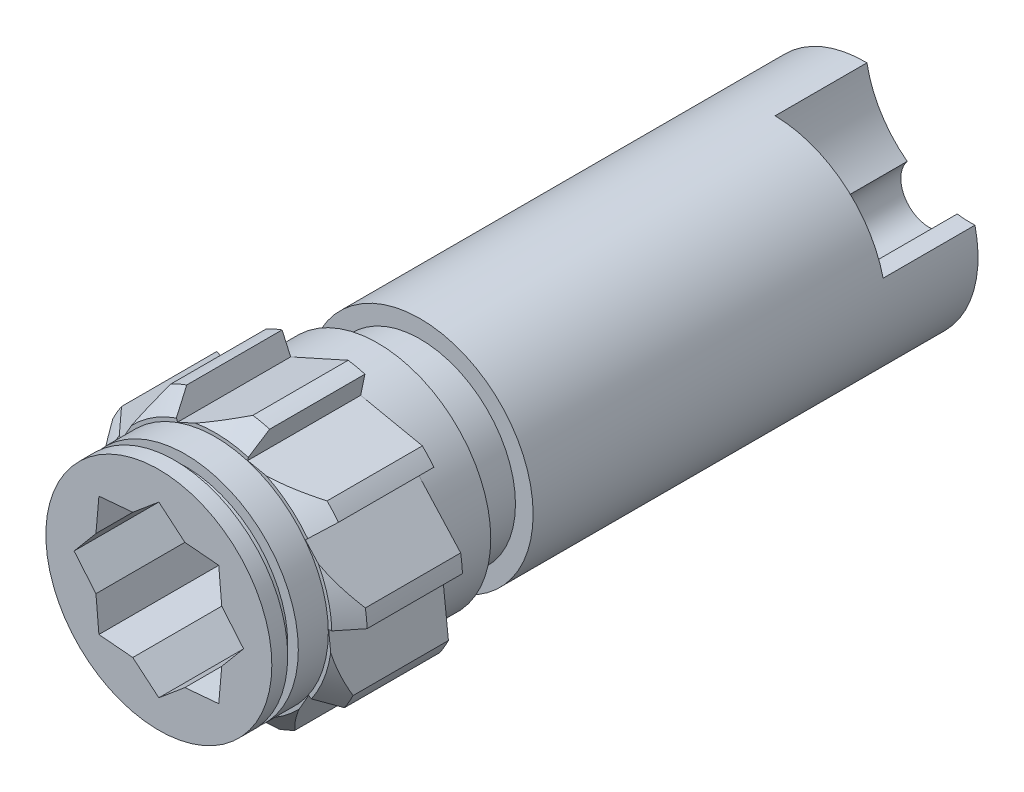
from build123d import *

# Parameters (mm, degrees)
ESQUISSE1_R                  = 16
ESQUISSE1_R_2                = 5
BASE_EXTRUSION_DEPTH         = 100
ESQUISSE2_R                  = 8
ENL_V_MAT_EXTRU_1_DEPTH      = 87.5
ESQUISSE3_OUTSIDE_W          = 55.952
ESQUISSE3_OUTSIDE_H          = 55.952
ESQUISSE3_OUTSIDE_R          = 13.5
ENL_V_MAT_EXTRU_2_DEPTH      = 6
ESQUISSE4_OUTSIDE_W          = 55.952
ESQUISSE4_OUTSIDE_H          = 55.952
ESQUISSE4_OUTSIDE_R          = 14.5
ENL_V_MAT_EXTRU_3_DEPTH      = 1.5
ENL_V_MAT_EXTRU_4_DEPTH      = 20
ESQUISSE7_R                  = 12
ENL_V_MAT_EXTRU_5_DEPTH      = 2
BOSS_EXTRU_1_START           = -16
ESQUISSE8_R                  = 19
ESQUISSE8_R_2                = 16
BOSS_EXTRU_1_DEPTH           = 16
ESQUISSE9_R                  = 4
ENL_V_MAT_EXTRU_6_DEPTH      = 13
ESQUISSE10_R                 = 15
ENL_V_MAT_EXTRU_8_DEPTH      = 13
R_P_TITION_CIRCULAIRE1_COUNT = 2
CHANFREIN1_SIZE              = 2.5
ENL_V_MAT_EXTRU_9_REACH      = 97.844
R_P_TITION_CIRCULAIRE2_COUNT = 10


with BuildPart() as part:
    # Esquisse1 → Base-Extrusion (new body)
    with BuildSketch(Plane.XY):
        Circle(ESQUISSE1_R)
        Circle(ESQUISSE1_R_2, mode=Mode.SUBTRACT)
    extrude(amount=BASE_EXTRUSION_DEPTH)

    # Esquisse2 → Enl_v. mat.-Extru.1 (cut)
    with BuildSketch(Plane.XY.offset(100)):
        Circle(ESQUISSE2_R)
    extrude(amount=-ENL_V_MAT_EXTRU_1_DEPTH, mode=Mode.SUBTRACT)

    # Esquisse3 outside → Enl_v. mat.-Extru.2 (cut)
    with BuildSketch(Plane.XY.offset(69)):
        Rectangle(ESQUISSE3_OUTSIDE_W, ESQUISSE3_OUTSIDE_H)
        Circle(ESQUISSE3_OUTSIDE_R, mode=Mode.SUBTRACT)
    extrude(amount=-ENL_V_MAT_EXTRU_2_DEPTH, mode=Mode.SUBTRACT)

    # Esquisse4 outside → Enl_v. mat.-Extru.3 (cut)
    with BuildSketch(Plane.XY.offset(97.75)):
        Rectangle(ESQUISSE4_OUTSIDE_W, ESQUISSE4_OUTSIDE_H)
        Circle(ESQUISSE4_OUTSIDE_R, mode=Mode.SUBTRACT)
    extrude(amount=-ENL_V_MAT_EXTRU_3_DEPTH, mode=Mode.SUBTRACT)

    # Esquisse6 → Enl_v. mat.-Extru.4 (cut)
    with BuildSketch(Plane.XY.offset(100)):
        Polygon((0, 12), (-3.688547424, 8.904941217), (-8.485281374, 8.485281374), (-8.904941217, 3.688547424), (-12, 0), (-8.904941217, -3.688547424), (-8.485281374, -8.485281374), (-3.688547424, -8.904941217), (0, -12), (3.688547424, -8.904941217), (8.485281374, -8.485281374), (8.904941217, -3.688547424), (12, 0), (8.904941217, 3.688547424), (8.485281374, 8.485281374), (3.688547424, 8.904941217), align=None)
    extrude(amount=-ENL_V_MAT_EXTRU_4_DEPTH, mode=Mode.SUBTRACT)

    # Esquisse7 → Enl_v. mat.-Extru.5 (cut)
    with BuildSketch(Plane.XY.offset(80)):
        Circle(ESQUISSE7_R)
    extrude(amount=-ENL_V_MAT_EXTRU_5_DEPTH, mode=Mode.SUBTRACT)

    # Esquisse8 → Boss.-Extru.1 (add)
    with BuildSketch(Plane.XY.offset(92).offset(BOSS_EXTRU_1_START)):
        Circle(ESQUISSE8_R)
        Circle(ESQUISSE8_R_2, mode=Mode.SUBTRACT)
    extrude(amount=BOSS_EXTRU_1_DEPTH)

    # Esquisse9 → Enl_v. mat.-Extru.6 (cut)
    with BuildSketch(Plane(origin=(0, 0, 0), x_dir=(-1, 0, 0), z_dir=(0, 0, -1))):
        with Locations(Location((9.06307787, -4.226182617, 0), (0, 0, 90))):
            Circle(ESQUISSE9_R)
    enl_v_mat_extru_6 = extrude(amount=-ENL_V_MAT_EXTRU_6_DEPTH, mode=Mode.SUBTRACT)

    # Esquisse10 → Enl_v. mat.-Extru.8 (cut)
    with BuildSketch(Plane(origin=(0, 0, 0), x_dir=(-1, 0, 0), z_dir=(0, 0, -1))):
        with Locations((15.017536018, -18.720940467)):
            Circle(ESQUISSE10_R)
    enl_v_mat_extru_8 = extrude(amount=-ENL_V_MAT_EXTRU_8_DEPTH, mode=Mode.SUBTRACT)

    # R_p_tition circulaire1: Enl_v. mat.-Extru.6, Enl_v. mat.-Extru.8 ×2 about axis
    r_p_tition_circulaire1_axis = Axis((0, 0, 0), (0, 0, 1))
    add([enl_v_mat_extru_6.rotate(r_p_tition_circulaire1_axis, i * 360 / R_P_TITION_CIRCULAIRE1_COUNT) for i in range(1, R_P_TITION_CIRCULAIRE1_COUNT)], mode=Mode.SUBTRACT)
    add([enl_v_mat_extru_8.rotate(r_p_tition_circulaire1_axis, i * 360 / R_P_TITION_CIRCULAIRE1_COUNT) for i in range(1, R_P_TITION_CIRCULAIRE1_COUNT)], mode=Mode.SUBTRACT)

    # Chanfrein1
    chanfrein1_edges = [part.edges().sort_by_distance(p)[0] for p in [
        (-19, 0, 92),
    ]]
    chamfer(chanfrein1_edges, length=CHANFREIN1_SIZE)

    # Esquisse11 → Enl_v. mat.-Extru.9 (cut, up to next)
    with BuildSketch(Plane.XY.offset(92), mode=Mode.PRIVATE) as enl_v_mat_extru_9_sk1:
        Polygon((16.906673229, 12.800250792), (4.581253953, 15.378410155), (5.605314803, 20.27414295), align=None)
    enl_v_mat_extru_9_tool1 = extrude(enl_v_mat_extru_9_sk1.sketch, amount=-ENL_V_MAT_EXTRU_9_REACH, mode=Mode.PRIVATE) & part.part
    enl_v_mat_extru_9 = enl_v_mat_extru_9_tool1.solids().sort_by_distance((9.031081, 16.150935, 92))[0]
    add(enl_v_mat_extru_9, mode=Mode.SUBTRACT)

    # R_p_tition circulaire2: Enl_v. mat.-Extru.9 ×10 about axis
    r_p_tition_circulaire2_axis = Axis((0, 0, 0), (0, 0, 1))
    for i in range(1, R_P_TITION_CIRCULAIRE2_COUNT):
        add(enl_v_mat_extru_9.rotate(r_p_tition_circulaire2_axis, i * 360 / R_P_TITION_CIRCULAIRE2_COUNT), mode=Mode.SUBTRACT)


solid = part.part
